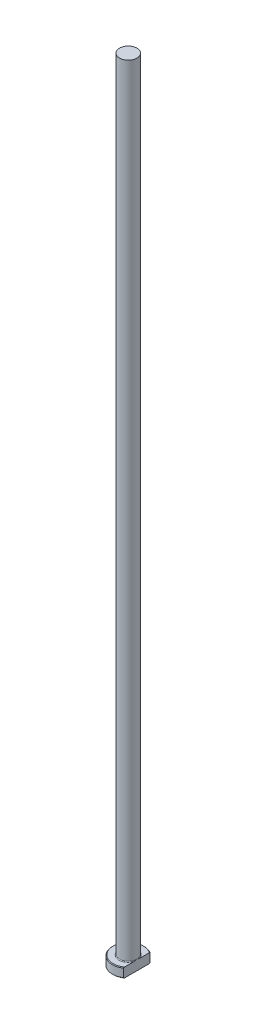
from build123d import *
from build123d.topology import SkipClean

# Parameters (mm, degrees)
CHAMFER1_SIZE = 0.2
FILLET1_R     = 0.2
KEY_DEPTH     = 251.099980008


with BuildPart() as part:
    # Sketch1 → Revolve1 (revolve)
    with BuildSketch(Plane.XY, mode=Mode.PRIVATE) as revolve1_sk:
        Polygon((0, 0), (-5, 0), (-5, 3), (-2.75, 3), (-2.75, 250), (0, 250), align=None)
    revolve(revolve1_sk.sketch.rotate(Axis((0, 259.958771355, 0), (0, -1, 0)), 270), axis=Axis((0, 259.958771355, 0), (0, -1, 0)))

    # Chamfer1
    chamfer1_edges = [part.edges().sort_by_distance(p)[0] for p in [
        (0, 3, -5),
        (0, 0, -5),
    ]]
    chamfer(chamfer1_edges, length=CHAMFER1_SIZE)

    # Fillet1
    fillet1_edges = [part.edges().sort_by_distance(p)[0] for p in [
        (0, 3, -2.75),
    ]]
    fillet(fillet1_edges, radius=FILLET1_R)

    # Sketch2 → KEY (cut, through all)
    with SkipClean():  # the faces are left unmerged after this step: merging them gives an invalid solid
        with BuildSketch(Plane(origin=(0, 0, 0), x_dir=(1, 0, 0), z_dir=(0, 1, 0))):
            with BuildLine():
                Line((2.75, 4.175823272), (2.75, -4.175823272))
                ThreePointArc((2.75, -4.175823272), (5, 0), (2.75, 4.175823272))
            make_face()
        extrude(amount=KEY_DEPTH, mode=Mode.SUBTRACT)


solid = part.part
